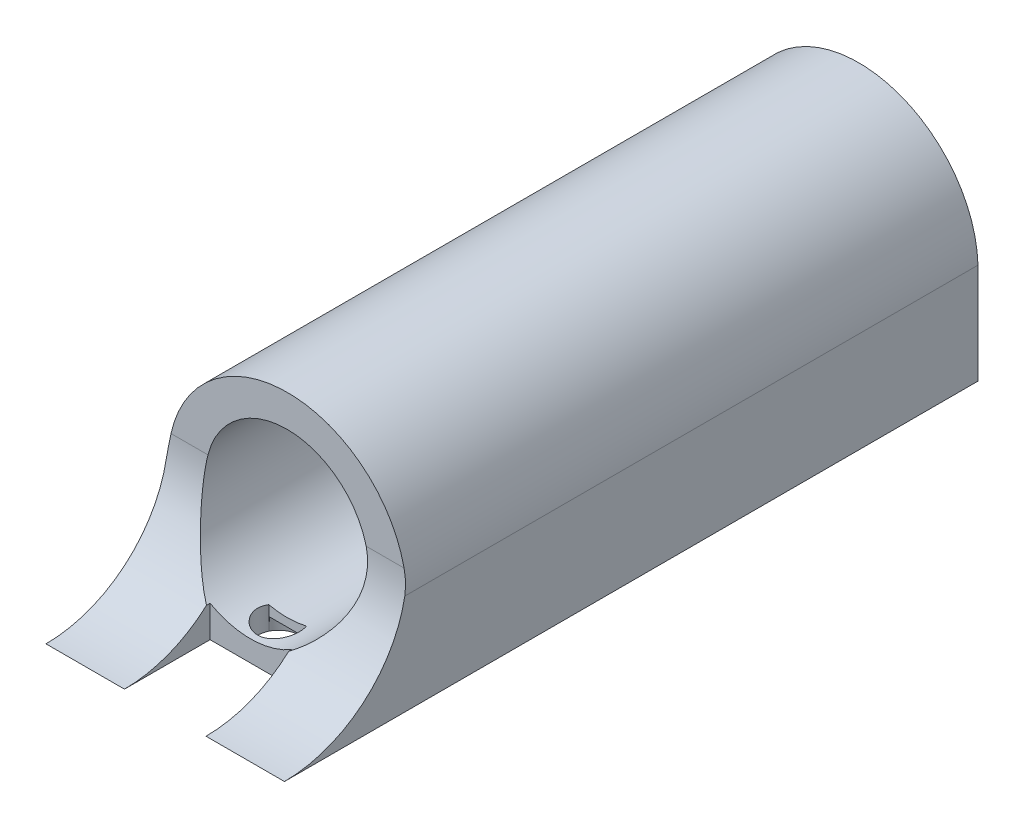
ISO-10303-21;
HEADER;
FILE_DESCRIPTION(('STEP AP214'),'2;1');
FILE_NAME('part.step','',(''),(''),'','','');
FILE_SCHEMA(('AUTOMOTIVE_DESIGN { 1 0 10303 214 1 1 1 1 }'));
ENDSEC;
DATA;
#1=APPLICATION_CONTEXT('core data for automotive mechanical design processes');
#2=APPLICATION_PROTOCOL_DEFINITION('international standard','automotive_design',2000,#1);
#3=PRODUCT_CONTEXT('',#1,'mechanical');
#4=PRODUCT('Part','Part','',(#3));
#5=PRODUCT_RELATED_PRODUCT_CATEGORY('part','',(#4));
#6=PRODUCT_DEFINITION_FORMATION('','',#4);
#7=PRODUCT_DEFINITION_CONTEXT('part definition',#1,'design');
#8=PRODUCT_DEFINITION('design','',#6,#7);
#9=PRODUCT_DEFINITION_SHAPE('','',#8);
#10=(LENGTH_UNIT() NAMED_UNIT(*) SI_UNIT(.MILLI.,.METRE.));
#11=(NAMED_UNIT(*) PLANE_ANGLE_UNIT() SI_UNIT($,.RADIAN.));
#12=(NAMED_UNIT(*) SI_UNIT($,.STERADIAN.) SOLID_ANGLE_UNIT());
#13=UNCERTAINTY_MEASURE_WITH_UNIT(LENGTH_MEASURE(1.E-05),#10,'distance_accuracy_value','');
#14=(GEOMETRIC_REPRESENTATION_CONTEXT(3) GLOBAL_UNCERTAINTY_ASSIGNED_CONTEXT((#13)) GLOBAL_UNIT_ASSIGNED_CONTEXT((#10,
#11,#12)) REPRESENTATION_CONTEXT('',''));
#15=CARTESIAN_POINT('',(0.,0.,0.));
#16=DIRECTION('',(0.,0.,1.));
#17=DIRECTION('',(1.,0.,0.));
#18=AXIS2_PLACEMENT_3D('',#15,#16,#17);
#19=CARTESIAN_POINT('',(31.8149068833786,36.7663866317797,-12.6919274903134));
#20=DIRECTION('',(0.,0.994521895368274,0.104528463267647));
#21=DIRECTION('',(1.,0.,0.));
#22=AXIS2_PLACEMENT_3D('',#19,#20,#21);
#23=CYLINDRICAL_SURFACE('',#22,3.23849999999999);
#24=CARTESIAN_POINT('',(31.8149068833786,24.2776075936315,-14.0045510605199));
#25=DIRECTION('',(0.,-1.,0.));
#26=DIRECTION('',(0.,0.,1.));
#27=AXIS2_PLACEMENT_3D('',#24,#25,#26);
#28=ELLIPSE('',#27,3.25633856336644,3.23849999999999);
#29=CARTESIAN_POINT('',(34.7373045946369,24.2776075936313,-15.4077571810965));
#30=VERTEX_POINT('',#29);
#31=CARTESIAN_POINT('',(28.8925091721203,24.2776075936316,-15.4077571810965));
#32=VERTEX_POINT('',#31);
#33=EDGE_CURVE('E170',#30,#32,#28,.F.);
#34=ORIENTED_EDGE('',*,*,#33,.F.);
#35=CARTESIAN_POINT('',(31.8149068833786,10.9269931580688,-15.4077571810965));
#36=DIRECTION('',(0.,0.,-1.));
#37=DIRECTION('',(0.,1.,0.));
#38=AXIS2_PLACEMENT_3D('',#35,#36,#37);
#39=ELLIPSE('',#38,30.9819918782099,3.23849999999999);
#40=CARTESIAN_POINT('',(34.6283142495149,26.2715150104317,-15.4077571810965));
#41=VERTEX_POINT('',#40);
#42=EDGE_CURVE('E11',#30,#41,#39,.F.);
#43=ORIENTED_EDGE('',*,*,#42,.T.);
#44=CARTESIAN_POINT('',(31.8149068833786,26.2715150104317,-13.7949829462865));
#45=DIRECTION('',(0.,1.,0.));
#46=DIRECTION('',(0.,0.,1.));
#47=AXIS2_PLACEMENT_3D('',#44,#45,#46);
#48=ELLIPSE('',#47,3.25633856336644,3.23849999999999);
#49=CARTESIAN_POINT('',(29.0014995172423,26.2715150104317,-15.4077571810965));
#50=VERTEX_POINT('',#49);
#51=EDGE_CURVE('E223',#50,#41,#48,.F.);
#52=ORIENTED_EDGE('',*,*,#51,.F.);
#53=CARTESIAN_POINT('',(31.8149068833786,10.9269931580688,-15.4077571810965));
#54=DIRECTION('',(0.,0.,-1.));
#55=DIRECTION('',(0.,1.,0.));
#56=AXIS2_PLACEMENT_3D('',#53,#54,#55);
#57=ELLIPSE('',#56,30.9819918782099,3.23849999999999);
#58=EDGE_CURVE('E27',#50,#32,#57,.F.);
#59=ORIENTED_EDGE('',*,*,#58,.T.);
#60=EDGE_LOOP('',(#34,#43,#52,#59));
#61=FACE_BOUND('',#60,.T.);
#62=ADVANCED_FACE('F16',(#61),#23,.F.);
#63=CARTESIAN_POINT('',(31.7387068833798,40.2415150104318,-192.846990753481));
#64=DIRECTION('',(0.,0.,1.));
#65=DIRECTION('',(1.,0.,0.));
#66=AXIS2_PLACEMENT_3D('',#63,#64,#65);
#67=CYLINDRICAL_SURFACE('',#66,12.7);
#68=CARTESIAN_POINT('',(31.7387068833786,40.2415150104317,-15.4077571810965));
#69=DIRECTION('',(0.,0.,1.));
#70=DIRECTION('',(1.,0.,0.));
#71=AXIS2_PLACEMENT_3D('',#68,#69,#70);
#72=CIRCLE('',#71,12.7);
#73=CARTESIAN_POINT('',(19.4193711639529,43.3276075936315,-15.4077571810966));
#74=VERTEX_POINT('',#73);
#75=CARTESIAN_POINT('',(44.0580426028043,43.3276075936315,-15.4077571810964));
#76=VERTEX_POINT('',#75);
#77=EDGE_CURVE('E130',#74,#76,#72,.F.);
#78=ORIENTED_EDGE('',*,*,#77,.F.);
#79=CARTESIAN_POINT('',(25.4649068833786,29.1993488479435,-9.13644274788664));
#80=CARTESIAN_POINT('',(25.2588227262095,29.3164647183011,-9.26594697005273));
#81=CARTESIAN_POINT('',(25.0570155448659,29.4387327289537,-9.39753074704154));
#82=CARTESIAN_POINT('',(24.6618501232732,29.6933639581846,-9.66353254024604));
#83=CARTESIAN_POINT('',(24.4684909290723,29.8257260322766,-9.79795023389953));
#84=CARTESIAN_POINT('',(24.0898521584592,30.1005209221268,-10.0684804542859));
#85=CARTESIAN_POINT('',(23.9045821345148,30.2429651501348,-10.2045947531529));
#86=CARTESIAN_POINT('',(23.5423749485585,30.5376675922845,-10.4772562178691));
#87=CARTESIAN_POINT('',(23.3654380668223,30.689926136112,-10.6138033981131));
#88=CARTESIAN_POINT('',(22.8442436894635,31.1640416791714,-11.0249319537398));
#89=CARTESIAN_POINT('',(22.5127905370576,31.5009260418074,-11.2986898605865));
#90=CARTESIAN_POINT('',(21.8862990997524,32.2137543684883,-11.8362568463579));
#91=CARTESIAN_POINT('',(21.5912360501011,32.5896714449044,-12.1000726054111));
#92=CARTESIAN_POINT('',(21.1266540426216,33.2569425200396,-12.5314798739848));
#93=CARTESIAN_POINT('',(20.9466439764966,33.5381997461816,-12.7034638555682));
#94=CARTESIAN_POINT('',(20.607116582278,34.1185513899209,-13.0373190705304));
#95=CARTESIAN_POINT('',(20.4475967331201,34.4176436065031,-13.1991915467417));
#96=CARTESIAN_POINT('',(20.1514506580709,35.0317852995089,-13.5100122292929));
#97=CARTESIAN_POINT('',(20.014743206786,35.3467727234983,-13.6590053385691));
#98=CARTESIAN_POINT('',(19.7655884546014,35.9924998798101,-13.9424933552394));
#99=CARTESIAN_POINT('',(19.6531376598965,36.3232373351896,-14.0769903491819));
#100=CARTESIAN_POINT('',(19.4699235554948,36.9467185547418,-14.3099116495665));
#101=CARTESIAN_POINT('',(19.3954083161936,37.2374791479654,-14.4107022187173));
#102=CARTESIAN_POINT('',(19.2665727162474,37.8275901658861,-14.5991439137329));
#103=CARTESIAN_POINT('',(19.2122488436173,38.1269390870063,-14.686797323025));
#104=CARTESIAN_POINT('',(19.1249758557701,38.7324334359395,-14.8478895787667));
#105=CARTESIAN_POINT('',(19.0920212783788,39.0385771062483,-14.9213320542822));
#106=CARTESIAN_POINT('',(19.0484593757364,39.6556487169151,-15.0531765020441));
#107=CARTESIAN_POINT('',(19.037848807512,39.9665759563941,-15.111580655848));
#108=CARTESIAN_POINT('',(19.0395045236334,40.5329112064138,-15.2034075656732));
#109=CARTESIAN_POINT('',(19.0478907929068,40.7879143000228,-15.2394549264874));
#110=CARTESIAN_POINT('',(19.0801607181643,41.2981856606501,-15.301093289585));
#111=CARTESIAN_POINT('',(19.104042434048,41.553453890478,-15.3266856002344));
#112=CARTESIAN_POINT('',(19.1674379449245,42.0634111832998,-15.3674863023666));
#113=CARTESIAN_POINT('',(19.2069839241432,42.3180979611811,-15.3826731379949));
#114=CARTESIAN_POINT('',(19.3015806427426,42.8250361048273,-15.4028242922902));
#115=CARTESIAN_POINT('',(19.3566343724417,43.0772869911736,-15.4077866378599));
#116=CARTESIAN_POINT('',(19.4193711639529,43.3276075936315,-15.4077571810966));
#117=B_SPLINE_CURVE_WITH_KNOTS('',3,(#79,#80,#81,#82,#83,#84,#85,#86,#87,#88,#89,#90,#91,#92,
#93,#94,#95,#96,#97,#98,#99,#100,#101,#102,#103,#104,#105,#106,#107,#108,#109,#110,#111,#112,
#113,#114,#115,#116),.UNSPECIFIED.,.F.,.F.,(4,2,2,2,2,2,2,2,2,2,2,2,2,2,2,2,2,2,4),(0.,
0.810184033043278,1.6202763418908,2.43130075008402,3.24235241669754,4.87809845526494,
6.51272509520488,7.63857992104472,8.76429609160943,9.88591433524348,11.0073709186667,
11.9562913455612,12.905046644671,13.8535593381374,14.8019343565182,15.5743121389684,
16.3465932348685,17.1204693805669,17.8944948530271),.UNSPECIFIED.);
#118=CARTESIAN_POINT('',(25.4649068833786,29.1993488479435,-9.13644274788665));
#119=VERTEX_POINT('',#118);
#120=EDGE_CURVE('E145',#119,#74,#117,.T.);
#121=ORIENTED_EDGE('',*,*,#120,.F.);
#122=DIRECTION('',(0.,0.,1.));
#123=VECTOR('',#122,1.);
#124=CARTESIAN_POINT('',(25.4649068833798,29.1993488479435,-192.846990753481));
#125=LINE('',#124,#123);
#126=CARTESIAN_POINT('',(25.4649068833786,29.1993488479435,-9.69275718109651));
#127=VERTEX_POINT('',#126);
#128=EDGE_CURVE('E526',#127,#119,#125,.T.);
#129=ORIENTED_EDGE('',*,*,#128,.F.);
#130=CARTESIAN_POINT('',(31.7387068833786,40.2415150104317,-9.69275718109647));
#131=DIRECTION('',(0.,0.,1.));
#132=DIRECTION('',(1.,0.,0.));
#133=AXIS2_PLACEMENT_3D('',#130,#131,#132);
#134=CIRCLE('',#133,12.7);
#135=CARTESIAN_POINT('',(38.1649068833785,29.28733984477,-9.69275718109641));
#136=VERTEX_POINT('',#135);
#137=EDGE_CURVE('E517',#136,#127,#134,.F.);
#138=ORIENTED_EDGE('',*,*,#137,.F.);
#139=DIRECTION('',(0.,0.,1.));
#140=VECTOR('',#139,1.);
#141=CARTESIAN_POINT('',(38.1649068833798,29.28733984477,-192.846990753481));
#142=LINE('',#141,#140);
#143=CARTESIAN_POINT('',(38.1649068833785,29.28733984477,-9.23305840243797));
#144=VERTEX_POINT('',#143);
#145=EDGE_CURVE('E528',#144,#136,#142,.F.);
#146=ORIENTED_EDGE('',*,*,#145,.F.);
#147=CARTESIAN_POINT('',(44.0580426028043,43.3276075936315,-15.4077571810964));
#148=CARTESIAN_POINT('',(44.095762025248,43.177040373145,-15.4077588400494));
#149=CARTESIAN_POINT('',(44.1307137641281,43.0257991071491,-15.4059715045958));
#150=CARTESIAN_POINT('',(44.1950372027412,42.7222226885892,-15.3987408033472));
#151=CARTESIAN_POINT('',(44.2244089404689,42.5698875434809,-15.3932974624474));
#152=CARTESIAN_POINT('',(44.3040646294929,42.1117531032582,-15.3713727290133));
#153=CARTESIAN_POINT('',(44.3459221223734,41.8046926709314,-15.3492967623));
#154=CARTESIAN_POINT('',(44.4068684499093,41.1913692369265,-15.2900966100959));
#155=CARTESIAN_POINT('',(44.4260695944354,40.8851098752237,-15.2530478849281));
#156=CARTESIAN_POINT('',(44.4423399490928,40.2741844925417,-15.1639897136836));
#157=CARTESIAN_POINT('',(44.4394094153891,39.9695184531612,-15.1119804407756));
#158=CARTESIAN_POINT('',(44.4119863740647,39.364148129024,-14.9934379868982));
#159=CARTESIAN_POINT('',(44.3875021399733,39.0634423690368,-14.926910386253));
#160=CARTESIAN_POINT('',(44.3178188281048,38.46785964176,-14.7800111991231));
#161=CARTESIAN_POINT('',(44.2726177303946,38.1729832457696,-14.6996382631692));
#162=CARTESIAN_POINT('',(44.1625070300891,37.5906546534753,-14.5259232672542));
#163=CARTESIAN_POINT('',(44.097585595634,37.3032070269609,-14.43257343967));
#164=CARTESIAN_POINT('',(43.9492109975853,36.737352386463,-14.2340251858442));
#165=CARTESIAN_POINT('',(43.8657574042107,36.4589455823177,-14.1288264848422));
#166=CARTESIAN_POINT('',(43.6769594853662,35.8987296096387,-13.9022731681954));
#167=CARTESIAN_POINT('',(43.5707340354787,35.6174377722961,-13.780375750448));
#168=CARTESIAN_POINT('',(43.3405561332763,35.0669476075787,-13.5262154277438));
#169=CARTESIAN_POINT('',(43.2165969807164,34.7977539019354,-13.3939486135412));
#170=CARTESIAN_POINT('',(42.9522175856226,34.2721113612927,-13.120463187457));
#171=CARTESIAN_POINT('',(42.811788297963,34.0156696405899,-12.9792396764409));
#172=CARTESIAN_POINT('',(42.5156939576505,33.5161246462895,-12.6893439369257));
#173=CARTESIAN_POINT('',(42.3600268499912,33.2730231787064,-12.5406707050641));
#174=CARTESIAN_POINT('',(42.0024257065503,32.7539233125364,-12.2074454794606));
#175=CARTESIAN_POINT('',(41.797417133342,32.4808735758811,-12.0215933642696));
#176=CARTESIAN_POINT('',(41.3684463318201,31.9545725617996,-11.6437491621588));
#177=CARTESIAN_POINT('',(41.1444800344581,31.7013255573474,-11.4517557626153));
#178=CARTESIAN_POINT('',(40.6788078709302,31.2150057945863,-11.0643524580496));
#179=CARTESIAN_POINT('',(40.4371145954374,30.9819189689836,-10.8689450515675));
#180=CARTESIAN_POINT('',(39.936518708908,30.5359386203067,-10.4773788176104));
#181=CARTESIAN_POINT('',(39.6776221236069,30.3230380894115,-10.2812202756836));
#182=CARTESIAN_POINT('',(39.2119449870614,29.9700677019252,-9.94164766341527));
#183=CARTESIAN_POINT('',(39.0090076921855,29.8254045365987,-9.79771595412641));
#184=CARTESIAN_POINT('',(38.5939431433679,29.5476940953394,-9.51283771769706));
#185=CARTESIAN_POINT('',(38.3818307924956,29.4146289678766,-9.37188686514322));
#186=CARTESIAN_POINT('',(38.1649068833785,29.28733984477,-9.23305840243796));
#187=B_SPLINE_CURVE_WITH_KNOTS('',3,(#147,#148,#149,#150,#151,#152,#153,#154,#155,#156,#157,
#158,#159,#160,#161,#162,#163,#164,#165,#166,#167,#168,#169,#170,#171,#172,#173,#174,#175,#176,
#177,#178,#179,#180,#181,#182,#183,#184,#185,#186),.UNSPECIFIED.,.F.,.F.,(4,2,2,2,2,2,2,2,2,2,2,
2,2,2,2,2,2,2,2,4),(0.,0.465585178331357,0.931167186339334,1.8619239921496,2.78804729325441,
3.71415987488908,4.63991711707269,5.56576464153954,6.49216875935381,7.41859436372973,
8.3910151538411,9.36380432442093,10.3371302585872,11.310587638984,12.4757361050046,
13.6411352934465,14.8057146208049,15.9698881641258,16.8329064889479,17.6945721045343),.UNSPECIFIED.);
#188=EDGE_CURVE('E129',#76,#144,#187,.T.);
#189=ORIENTED_EDGE('',*,*,#188,.F.);
#190=EDGE_LOOP('',(#78,#121,#129,#138,#146,#189));
#191=FACE_BOUND('',#190,.T.);
#192=CARTESIAN_POINT('',(31.7387068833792,40.2415150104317,-104.357657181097));
#193=DIRECTION('',(0.,0.,-1.));
#194=DIRECTION('',(-1.,0.,0.));
#195=AXIS2_PLACEMENT_3D('',#192,#193,#194);
#196=CIRCLE('',#195,12.7);
#197=CARTESIAN_POINT('',(19.0387068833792,40.2415150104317,-104.357657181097));
#198=VERTEX_POINT('',#197);
#199=EDGE_CURVE('E494',#198,#198,#196,.F.);
#200=ORIENTED_EDGE('',*,*,#199,.F.);
#201=EDGE_LOOP('',(#200));
#202=FACE_BOUND('',#201,.T.);
#203=CARTESIAN_POINT('',(28.8925091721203,27.8645542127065,-15.4077571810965));
#204=CARTESIAN_POINT('',(28.8540919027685,27.8733934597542,-15.3268845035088));
#205=CARTESIAN_POINT('',(28.818992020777,27.8816488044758,-15.2443687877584));
#206=CARTESIAN_POINT('',(28.7556488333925,27.8967809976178,-15.0766175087));
#207=CARTESIAN_POINT('',(28.7274060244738,27.9036577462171,-14.9913817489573));
#208=CARTESIAN_POINT('',(28.6780165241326,27.9158177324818,-14.8188108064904));
#209=CARTESIAN_POINT('',(28.6568663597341,27.9211017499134,-14.7314766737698));
#210=CARTESIAN_POINT('',(28.6218093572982,27.9299237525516,-14.5552836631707));
#211=CARTESIAN_POINT('',(28.6079021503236,27.9334618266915,-14.4664248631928));
#212=CARTESIAN_POINT('',(28.5874346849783,27.9386862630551,-14.2877281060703));
#213=CARTESIAN_POINT('',(28.580881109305,27.9403709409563,-14.1978893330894));
#214=CARTESIAN_POINT('',(28.5751961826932,27.9418317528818,-14.0179298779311));
#215=CARTESIAN_POINT('',(28.5760675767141,27.9416071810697,-13.9278091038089));
#216=CARTESIAN_POINT('',(28.5852313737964,27.9392543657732,-13.7480385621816));
#217=CARTESIAN_POINT('',(28.5935177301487,27.9371276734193,-13.6583884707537));
#218=CARTESIAN_POINT('',(28.6174264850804,27.9310418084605,-13.4801253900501));
#219=CARTESIAN_POINT('',(28.633051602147,27.9270819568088,-13.3915127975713));
#220=CARTESIAN_POINT('',(28.6904603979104,27.9126944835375,-13.1296636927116));
#221=CARTESIAN_POINT('',(28.7428648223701,27.8997338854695,-12.958763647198));
#222=CARTESIAN_POINT('',(28.8745477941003,27.86851540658,-12.6282191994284));
#223=CARTESIAN_POINT('',(28.9538377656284,27.8502552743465,-12.4685796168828));
#224=CARTESIAN_POINT('',(29.1388544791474,27.8101081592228,-12.1616817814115));
#225=CARTESIAN_POINT('',(29.2450572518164,27.7881585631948,-12.0147182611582));
#226=CARTESIAN_POINT('',(29.4802708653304,27.7433648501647,-11.7405312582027));
#227=CARTESIAN_POINT('',(29.6092801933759,27.7205207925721,-11.6133064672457));
#228=CARTESIAN_POINT('',(29.8894155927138,27.6760624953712,-11.3797901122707));
#229=CARTESIAN_POINT('',(30.0409101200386,27.654479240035,-11.2739344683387));
#230=CARTESIAN_POINT('',(30.3602148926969,27.615529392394,-11.0893395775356));
#231=CARTESIAN_POINT('',(30.5280228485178,27.5981622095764,-11.0105965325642));
#232=CARTESIAN_POINT('',(30.7900253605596,27.5766825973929,-10.9141137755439));
#233=CARTESIAN_POINT('',(30.8801222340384,27.570240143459,-10.8853669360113));
#234=CARTESIAN_POINT('',(31.0626245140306,27.5591945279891,-10.8358637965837));
#235=CARTESIAN_POINT('',(31.1550299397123,27.5545913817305,-10.8151075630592));
#236=CARTESIAN_POINT('',(31.341614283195,27.5473809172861,-10.7817636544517));
#237=CARTESIAN_POINT('',(31.4357970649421,27.544778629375,-10.7691965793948));
#238=CARTESIAN_POINT('',(31.6249551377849,27.5416690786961,-10.7524133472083));
#239=CARTESIAN_POINT('',(31.719930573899,27.5411622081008,-10.7481987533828));
#240=CARTESIAN_POINT('',(31.8149068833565,27.541743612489,-10.7482124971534));
#241=B_SPLINE_CURVE_WITH_KNOTS('',3,(#203,#204,#205,#206,#207,#208,#209,#210,#211,#212,#213,
#214,#215,#216,#217,#218,#219,#220,#221,#222,#223,#224,#225,#226,#227,#228,#229,#230,#231,#232,
#233,#234,#235,#236,#237,#238,#239,#240),.UNSPECIFIED.,.F.,.F.,(4,2,2,2,2,2,2,2,2,2,2,2,2,2,2,2,
2,2,4),(0.,0.269834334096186,0.539688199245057,0.80940973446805,1.07911752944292,
1.34907022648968,1.61912272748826,1.88895520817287,2.15888772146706,2.69385140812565,
3.22904269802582,3.77445646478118,4.31983406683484,4.87540979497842,5.43090766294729,
5.71496220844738,5.99901911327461,6.28378783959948,6.5686098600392),.UNSPECIFIED.);
#242=CARTESIAN_POINT('',(28.8925091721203,27.8645542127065,-15.4077571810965));
#243=VERTEX_POINT('',#242);
#244=CARTESIAN_POINT('',(31.8149068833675,27.541743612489,-10.7482124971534));
#245=VERTEX_POINT('',#244);
#246=EDGE_CURVE('E139',#243,#245,#241,.T.);
#247=ORIENTED_EDGE('',*,*,#246,.F.);
#248=CARTESIAN_POINT('',(31.7387068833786,40.2415150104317,-15.4077571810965));
#249=DIRECTION('',(0.,0.,-1.));
#250=DIRECTION('',(-1.,0.,0.));
#251=AXIS2_PLACEMENT_3D('',#248,#249,#250);
#252=CIRCLE('',#251,12.7);
#253=CARTESIAN_POINT('',(34.7373045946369,27.9005907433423,-15.4077571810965));
#254=VERTEX_POINT('',#253);
#255=EDGE_CURVE('E156',#243,#254,#252,.F.);
#256=ORIENTED_EDGE('',*,*,#255,.T.);
#257=CARTESIAN_POINT('',(31.8149068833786,27.541743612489,-10.7482124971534));
#258=CARTESIAN_POINT('',(31.9041876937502,27.5422703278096,-10.7482019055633));
#259=CARTESIAN_POINT('',(31.9934563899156,27.5437562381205,-10.75192468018));
#260=CARTESIAN_POINT('',(32.171313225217,27.5485758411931,-10.7667518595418));
#261=CARTESIAN_POINT('',(32.2599014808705,27.5519092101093,-10.7778549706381));
#262=CARTESIAN_POINT('',(32.4355917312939,27.5603446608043,-10.8073273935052));
#263=CARTESIAN_POINT('',(32.522696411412,27.5654430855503,-10.8256816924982));
#264=CARTESIAN_POINT('',(32.6949673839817,27.5772726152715,-10.8694800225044));
#265=CARTESIAN_POINT('',(32.780133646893,27.58400374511,-10.8949241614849));
#266=CARTESIAN_POINT('',(33.0318152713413,27.6064007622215,-10.9815999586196));
#267=CARTESIAN_POINT('',(33.1946963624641,27.6242795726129,-11.0532059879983));
#268=CARTESIAN_POINT('',(33.5060990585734,27.6641119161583,-11.2218005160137));
#269=CARTESIAN_POINT('',(33.6546169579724,27.6860664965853,-11.3187955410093));
#270=CARTESIAN_POINT('',(33.9367688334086,27.7323421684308,-11.5378747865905));
#271=CARTESIAN_POINT('',(34.070008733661,27.7567043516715,-11.6604589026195));
#272=CARTESIAN_POINT('',(34.3144003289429,27.8048209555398,-11.9260807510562));
#273=CARTESIAN_POINT('',(34.425545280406,27.8285751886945,-12.0691247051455));
#274=CARTESIAN_POINT('',(34.6248471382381,27.8733750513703,-12.3751893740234));
#275=CARTESIAN_POINT('',(34.7124917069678,27.8943559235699,-12.5385566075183));
#276=CARTESIAN_POINT('',(34.8223807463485,27.9215166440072,-12.7931370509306));
#277=CARTESIAN_POINT('',(34.8554215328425,27.9298538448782,-12.8796158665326));
#278=CARTESIAN_POINT('',(34.9140838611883,27.944852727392,-13.055184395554));
#279=CARTESIAN_POINT('',(34.9397084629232,27.9515150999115,-13.1442730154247));
#280=CARTESIAN_POINT('',(34.9829558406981,27.9628611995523,-13.3229014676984));
#281=CARTESIAN_POINT('',(35.0007055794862,27.9675762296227,-13.4124086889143));
#282=CARTESIAN_POINT('',(35.0286722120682,27.9750428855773,-13.5926395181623));
#283=CARTESIAN_POINT('',(35.0388921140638,27.9777952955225,-13.6833626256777));
#284=CARTESIAN_POINT('',(35.0517253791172,27.9812559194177,-13.865458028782));
#285=CARTESIAN_POINT('',(35.0543325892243,27.9819624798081,-13.9568307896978));
#286=CARTESIAN_POINT('',(35.0519010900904,27.9813051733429,-14.1394328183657));
#287=CARTESIAN_POINT('',(35.0468651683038,27.9799420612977,-14.23066212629));
#288=CARTESIAN_POINT('',(35.028877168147,27.9751027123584,-14.4156058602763));
#289=CARTESIAN_POINT('',(35.0156462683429,27.9715520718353,-14.509291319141));
#290=CARTESIAN_POINT('',(34.9811509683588,27.9623916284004,-14.6950765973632));
#291=CARTESIAN_POINT('',(34.9598857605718,27.9567816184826,-14.7871762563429));
#292=CARTESIAN_POINT('',(34.9094836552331,27.9436752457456,-14.9691608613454));
#293=CARTESIAN_POINT('',(34.8803384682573,27.9361768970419,-15.0590433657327));
#294=CARTESIAN_POINT('',(34.8144524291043,27.9195467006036,-15.2358118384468));
#295=CARTESIAN_POINT('',(34.7777125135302,27.9104150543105,-15.3226981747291));
#296=CARTESIAN_POINT('',(34.7373045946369,27.9005907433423,-15.4077571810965));
#297=B_SPLINE_CURVE_WITH_KNOTS('',3,(#257,#258,#259,#260,#261,#262,#263,#264,#265,#266,#267,
#268,#269,#270,#271,#272,#273,#274,#275,#276,#277,#278,#279,#280,#281,#282,#283,#284,#285,#286,
#287,#288,#289,#290,#291,#292,#293,#294,#295,#296),.UNSPECIFIED.,.F.,.F.,(4,2,2,2,2,2,2,2,2,2,2,
2,2,2,2,2,2,2,2,4),(0.,0.267753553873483,0.53546018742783,0.802615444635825,1.06977477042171,
1.60354322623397,2.13744902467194,2.6829695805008,3.22865637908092,3.78541821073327,
4.06398481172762,4.34243631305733,4.6162190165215,4.88989228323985,5.16378668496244,
5.43758122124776,5.72124564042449,6.00493858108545,6.28893112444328,6.57288866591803),.UNSPECIFIED.);
#298=EDGE_CURVE('E228',#245,#254,#297,.T.);
#299=ORIENTED_EDGE('',*,*,#298,.F.);
#300=EDGE_LOOP('',(#247,#256,#299));
#301=FACE_BOUND('',#300,.T.);
#302=ADVANCED_FACE('F205',(#191,#202,#301),#67,.F.);
#303=CARTESIAN_POINT('',(-437.084132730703,24.2776075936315,137.712993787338));
#304=DIRECTION('',(0.,-1.,0.));
#305=DIRECTION('',(1.,0.,0.));
#306=AXIS2_PLACEMENT_3D('',#303,#304,#305);
#307=PLANE('',#306);
#308=DIRECTION('',(0.,0.,1.));
#309=VECTOR('',#308,1.);
#310=CARTESIAN_POINT('',(13.2483019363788,24.2776075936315,140.88791943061));
#311=LINE('',#310,#309);
#312=CARTESIAN_POINT('',(13.2483019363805,24.2776075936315,-104.357657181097));
#313=VERTEX_POINT('',#312);
#314=CARTESIAN_POINT('',(13.2483019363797,24.2776075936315,3.64224281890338));
#315=VERTEX_POINT('',#314);
#316=EDGE_CURVE('E177',#313,#315,#311,.T.);
#317=ORIENTED_EDGE('',*,*,#316,.F.);
#318=DIRECTION('',(1.,0.,0.));
#319=VECTOR('',#318,1.);
#320=CARTESIAN_POINT('',(-437.084132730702,24.2776075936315,-104.357657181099));
#321=LINE('',#320,#319);
#322=CARTESIAN_POINT('',(50.381511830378,24.2776075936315,-104.357657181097));
#323=VERTEX_POINT('',#322);
#324=EDGE_CURVE('E159',#313,#323,#321,.T.);
#325=ORIENTED_EDGE('',*,*,#324,.T.);
#326=DIRECTION('',(0.,0.,-1.));
#327=VECTOR('',#326,1.);
#328=CARTESIAN_POINT('',(50.3815118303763,24.2776075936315,137.712993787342));
#329=LINE('',#328,#327);
#330=CARTESIAN_POINT('',(50.3815118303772,24.2776075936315,3.64224281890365));
#331=VERTEX_POINT('',#330);
#332=EDGE_CURVE('E162',#323,#331,#329,.F.);
#333=ORIENTED_EDGE('',*,*,#332,.T.);
#334=DIRECTION('',(-1.,0.,0.));
#335=VECTOR('',#334,1.);
#336=CARTESIAN_POINT('',(50.3815118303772,24.2776075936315,3.64224281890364));
#337=LINE('',#336,#335);
#338=CARTESIAN_POINT('',(38.1649068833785,24.2776075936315,3.64224281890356));
#339=VERTEX_POINT('',#338);
#340=EDGE_CURVE('E165',#331,#339,#337,.T.);
#341=ORIENTED_EDGE('',*,*,#340,.T.);
#342=DIRECTION('',(0.,0.,1.));
#343=VECTOR('',#342,1.);
#344=CARTESIAN_POINT('',(38.1649068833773,24.2776075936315,162.392242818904));
#345=LINE('',#344,#343);
#346=CARTESIAN_POINT('',(38.1649068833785,24.2776075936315,-9.69275718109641));
#347=VERTEX_POINT('',#346);
#348=EDGE_CURVE('E533',#347,#339,#345,.T.);
#349=ORIENTED_EDGE('',*,*,#348,.F.);
#350=DIRECTION('',(1.,0.,0.));
#351=VECTOR('',#350,1.);
#352=CARTESIAN_POINT('',(31.8149068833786,24.2776075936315,-9.69275718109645));
#353=LINE('',#352,#351);
#354=CARTESIAN_POINT('',(25.4649068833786,24.2776075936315,-9.69275718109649));
#355=VERTEX_POINT('',#354);
#356=EDGE_CURVE('E518',#355,#347,#353,.T.);
#357=ORIENTED_EDGE('',*,*,#356,.F.);
#358=DIRECTION('',(0.,0.,-1.));
#359=VECTOR('',#358,1.);
#360=CARTESIAN_POINT('',(25.4649068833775,24.2776075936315,137.712993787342));
#361=LINE('',#360,#359);
#362=CARTESIAN_POINT('',(25.4649068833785,24.2776075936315,3.64224281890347));
#363=VERTEX_POINT('',#362);
#364=EDGE_CURVE('E166',#355,#363,#361,.F.);
#365=ORIENTED_EDGE('',*,*,#364,.T.);
#366=DIRECTION('',(-1.,0.,0.));
#367=VECTOR('',#366,1.);
#368=CARTESIAN_POINT('',(25.4649068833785,24.2776075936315,3.64224281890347));
#369=LINE('',#368,#367);
#370=EDGE_CURVE('E169',#363,#315,#369,.T.);
#371=ORIENTED_EDGE('',*,*,#370,.T.);
#372=EDGE_LOOP('',(#317,#325,#333,#341,#349,#357,#365,#371));
#373=FACE_BOUND('',#372,.T.);
#374=CARTESIAN_POINT('',(31.8149068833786,24.2776075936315,-10.7482124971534));
#375=CARTESIAN_POINT('',(31.9056274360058,24.2776075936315,-10.748203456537));
#376=CARTESIAN_POINT('',(31.9963436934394,24.2776075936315,-10.752045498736));
#377=CARTESIAN_POINT('',(32.1771244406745,24.2776075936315,-10.7673618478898));
#378=CARTESIAN_POINT('',(32.2671889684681,24.2776075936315,-10.7788357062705));
#379=CARTESIAN_POINT('',(32.445959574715,24.2776075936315,-10.8093331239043));
#380=CARTESIAN_POINT('',(32.5346667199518,24.2776075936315,-10.8283504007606));
#381=CARTESIAN_POINT('',(32.7101414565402,24.2776075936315,-10.873775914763));
#382=CARTESIAN_POINT('',(32.7969090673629,24.2776075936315,-10.9001840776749));
#383=CARTESIAN_POINT('',(33.0534544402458,24.2776075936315,-10.9902688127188));
#384=CARTESIAN_POINT('',(33.2195604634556,24.2776075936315,-11.0648203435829));
#385=CARTESIAN_POINT('',(33.5368155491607,24.2776075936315,-11.24063521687));
#386=CARTESIAN_POINT('',(33.6879672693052,24.2776075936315,-11.3418938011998));
#387=CARTESIAN_POINT('',(33.9716021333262,24.2776075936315,-11.5685179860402));
#388=CARTESIAN_POINT('',(34.1040389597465,24.2776075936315,-11.6939416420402));
#389=CARTESIAN_POINT('',(34.3461293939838,24.2776075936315,-11.9651649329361));
#390=CARTESIAN_POINT('',(34.4557777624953,24.2776075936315,-12.1109692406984));
#391=CARTESIAN_POINT('',(34.6497600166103,24.2776075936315,-12.4196007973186));
#392=CARTESIAN_POINT('',(34.7339598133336,24.2776075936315,-12.5825123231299));
#393=CARTESIAN_POINT('',(34.873947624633,24.2776075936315,-12.9200843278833));
#394=CARTESIAN_POINT('',(34.9297404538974,24.2776075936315,-13.0947428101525));
#395=CARTESIAN_POINT('',(35.0116277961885,24.2776075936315,-13.4517646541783));
#396=CARTESIAN_POINT('',(35.03757565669,24.2776075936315,-13.6341615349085));
#397=CARTESIAN_POINT('',(35.058544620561,24.2776075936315,-14.0008575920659));
#398=CARTESIAN_POINT('',(35.0535597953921,24.2776075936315,-14.1851571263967));
#399=CARTESIAN_POINT('',(35.0231884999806,24.2776075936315,-14.457535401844));
#400=CARTESIAN_POINT('',(35.0094186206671,24.2776075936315,-14.5470539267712));
#401=CARTESIAN_POINT('',(34.9745074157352,24.2776075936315,-14.7246664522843));
#402=CARTESIAN_POINT('',(34.9533661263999,24.2776075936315,-14.8127604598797));
#403=CARTESIAN_POINT('',(34.9038343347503,24.2776075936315,-14.9869325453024));
#404=CARTESIAN_POINT('',(34.8754398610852,24.2776075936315,-15.0730094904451));
#405=CARTESIAN_POINT('',(34.8116059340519,24.2776075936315,-15.242516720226));
#406=CARTESIAN_POINT('',(34.7761659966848,24.2776075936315,-15.3259468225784));
#407=CARTESIAN_POINT('',(34.7373045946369,24.2776075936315,-15.4077571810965));
#408=B_SPLINE_CURVE_WITH_KNOTS('',3,(#374,#375,#376,#377,#378,#379,#380,#381,#382,#383,#384,
#385,#386,#387,#388,#389,#390,#391,#392,#393,#394,#395,#396,#397,#398,#399,#400,#401,#402,#403,
#404,#405,#406,#407),.UNSPECIFIED.,.F.,.F.,(4,2,2,2,2,2,2,2,2,2,2,2,2,2,2,2,4),(0.,
0.272072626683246,0.544129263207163,0.815959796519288,1.0877875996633,1.63118557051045,
2.17448679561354,2.71910993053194,3.2638581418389,3.81142851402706,4.35890604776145,
4.90906244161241,5.45932428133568,5.73078468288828,6.00224374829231,6.2738517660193,
6.54547844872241),.UNSPECIFIED.);
#409=CARTESIAN_POINT('',(31.8149068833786,24.2776075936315,-10.7482124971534));
#410=VERTEX_POINT('',#409);
#411=EDGE_CURVE('E36',#30,#410,#408,.F.);
#412=ORIENTED_EDGE('',*,*,#411,.F.);
#413=ORIENTED_EDGE('',*,*,#33,.T.);
#414=CARTESIAN_POINT('',(28.8925091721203,24.2776075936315,-15.4077571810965));
#415=CARTESIAN_POINT('',(28.8530302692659,24.2776075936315,-15.3246478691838));
#416=CARTESIAN_POINT('',(28.8170829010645,24.2776075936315,-15.2398667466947));
#417=CARTESIAN_POINT('',(28.7524627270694,24.2776075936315,-15.0675816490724));
#418=CARTESIAN_POINT('',(28.7237894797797,24.2776075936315,-14.9800778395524));
#419=CARTESIAN_POINT('',(28.6739414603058,24.2776075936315,-14.8030192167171));
#420=CARTESIAN_POINT('',(28.6527615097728,24.2776075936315,-14.7134658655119));
#421=CARTESIAN_POINT('',(28.6180127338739,24.2776075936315,-14.5329203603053));
#422=CARTESIAN_POINT('',(28.604443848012,24.2776075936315,-14.441928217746));
#423=CARTESIAN_POINT('',(28.575318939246,24.2776075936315,-14.1676689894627));
#424=CARTESIAN_POINT('',(28.5713203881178,24.2776075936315,-13.9830325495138));
#425=CARTESIAN_POINT('',(28.5943553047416,24.2776075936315,-13.6158419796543));
#426=CARTESIAN_POINT('',(28.6213825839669,24.2776075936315,-13.433287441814));
#427=CARTESIAN_POINT('',(28.7057273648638,24.2776075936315,-13.0751281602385));
#428=CARTESIAN_POINT('',(28.7630696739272,24.2776075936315,-12.899529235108));
#429=CARTESIAN_POINT('',(28.9064993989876,24.2776075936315,-12.5604532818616));
#430=CARTESIAN_POINT('',(28.9925924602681,24.2776075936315,-12.3969786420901));
#431=CARTESIAN_POINT('',(29.1908910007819,24.2776075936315,-12.0872446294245));
#432=CARTESIAN_POINT('',(29.303036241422,24.2776075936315,-11.9409466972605));
#433=CARTESIAN_POINT('',(29.5503914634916,24.2776075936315,-11.6693968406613));
#434=CARTESIAN_POINT('',(29.6855964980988,24.2776075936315,-11.5441404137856));
#435=CARTESIAN_POINT('',(29.9745274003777,24.2776075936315,-11.3188520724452));
#436=CARTESIAN_POINT('',(30.1281614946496,24.2776075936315,-11.2187022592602));
#437=CARTESIAN_POINT('',(30.4502541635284,24.2776075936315,-11.0457436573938));
#438=CARTESIAN_POINT('',(30.618714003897,24.2776075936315,-10.9729372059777));
#439=CARTESIAN_POINT('',(30.8741934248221,24.2776075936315,-10.8873955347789));
#440=CARTESIAN_POINT('',(30.9575351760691,24.2776075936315,-10.8631905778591));
#441=CARTESIAN_POINT('',(31.1259177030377,24.2776075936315,-10.8215684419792));
#442=CARTESIAN_POINT('',(31.2109584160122,24.2776075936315,-10.8041510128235));
#443=CARTESIAN_POINT('',(31.3821959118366,24.2776075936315,-10.7762320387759));
#444=CARTESIAN_POINT('',(31.4683931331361,24.2776075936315,-10.7657331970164));
#445=CARTESIAN_POINT('',(31.6413611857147,24.2776075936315,-10.7517193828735));
#446=CARTESIAN_POINT('',(31.7281320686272,24.2776075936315,-10.74820504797));
#447=CARTESIAN_POINT('',(31.8149068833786,24.2776075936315,-10.7482124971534));
#448=B_SPLINE_CURVE_WITH_KNOTS('',3,(#414,#415,#416,#417,#418,#419,#420,#421,#422,#423,#424,
#425,#426,#427,#428,#429,#430,#431,#432,#433,#434,#435,#436,#437,#438,#439,#440,#441,#442,#443,
#444,#445,#446,#447),.UNSPECIFIED.,.F.,.F.,(4,2,2,2,2,2,2,2,2,2,2,2,2,2,2,2,4),(0.,
0.275937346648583,0.551857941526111,0.827587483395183,1.10331483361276,1.65450324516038,
2.20558173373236,2.75711188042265,3.30875038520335,3.85912585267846,4.40938340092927,
4.95700642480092,5.50467624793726,5.76480666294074,6.0249274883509,6.28514988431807,
6.54539602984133),.UNSPECIFIED.);
#449=EDGE_CURVE('E152',#410,#32,#448,.F.);
#450=ORIENTED_EDGE('',*,*,#449,.F.);
#451=EDGE_LOOP('',(#412,#413,#450));
#452=FACE_BOUND('',#451,.T.);
#453=CARTESIAN_POINT('',(41.8149068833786,24.2776075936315,-22.2608896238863));
#454=DIRECTION('',(0.,-1.,0.));
#455=DIRECTION('',(1.,0.,0.));
#456=AXIS2_PLACEMENT_3D('',#453,#454,#455);
#457=CIRCLE('',#456,2.);
#458=CARTESIAN_POINT('',(43.8149068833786,24.2776075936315,-22.2608896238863));
#459=VERTEX_POINT('',#458);
#460=EDGE_CURVE('E337',#459,#459,#457,.T.);
#461=ORIENTED_EDGE('',*,*,#460,.F.);
#462=EDGE_LOOP('',(#461));
#463=FACE_BOUND('',#462,.T.);
#464=CARTESIAN_POINT('',(41.8149068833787,24.2776075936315,-32.2608896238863));
#465=DIRECTION('',(0.,-1.,0.));
#466=DIRECTION('',(1.,0.,0.));
#467=AXIS2_PLACEMENT_3D('',#464,#465,#466);
#468=CIRCLE('',#467,2.);
#469=CARTESIAN_POINT('',(43.8149068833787,24.2776075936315,-32.2608896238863));
#470=VERTEX_POINT('',#469);
#471=EDGE_CURVE('E341',#470,#470,#468,.T.);
#472=ORIENTED_EDGE('',*,*,#471,.F.);
#473=EDGE_LOOP('',(#472));
#474=FACE_BOUND('',#473,.T.);
#475=CARTESIAN_POINT('',(41.8149068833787,24.2776075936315,-42.2608896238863));
#476=DIRECTION('',(0.,-1.,0.));
#477=DIRECTION('',(1.,0.,0.));
#478=AXIS2_PLACEMENT_3D('',#475,#476,#477);
#479=CIRCLE('',#478,2.);
#480=CARTESIAN_POINT('',(43.8149068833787,24.2776075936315,-42.2608896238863));
#481=VERTEX_POINT('',#480);
#482=EDGE_CURVE('E345',#481,#481,#479,.T.);
#483=ORIENTED_EDGE('',*,*,#482,.F.);
#484=EDGE_LOOP('',(#483));
#485=FACE_BOUND('',#484,.T.);
#486=CARTESIAN_POINT('',(31.8149068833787,24.2776075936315,-32.2608896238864));
#487=DIRECTION('',(0.,-1.,0.));
#488=DIRECTION('',(1.,0.,0.));
#489=AXIS2_PLACEMENT_3D('',#486,#487,#488);
#490=CIRCLE('',#489,2.);
#491=CARTESIAN_POINT('',(33.8149068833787,24.2776075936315,-32.2608896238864));
#492=VERTEX_POINT('',#491);
#493=EDGE_CURVE('E349',#492,#492,#490,.T.);
#494=ORIENTED_EDGE('',*,*,#493,.F.);
#495=EDGE_LOOP('',(#494));
#496=FACE_BOUND('',#495,.T.);
#497=CARTESIAN_POINT('',(31.8149068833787,24.2776075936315,-42.2608896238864));
#498=DIRECTION('',(0.,-1.,0.));
#499=DIRECTION('',(1.,0.,0.));
#500=AXIS2_PLACEMENT_3D('',#497,#498,#499);
#501=CIRCLE('',#500,2.);
#502=CARTESIAN_POINT('',(33.8149068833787,24.2776075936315,-42.2608896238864));
#503=VERTEX_POINT('',#502);
#504=EDGE_CURVE('E353',#503,#503,#501,.T.);
#505=ORIENTED_EDGE('',*,*,#504,.F.);
#506=EDGE_LOOP('',(#505));
#507=FACE_BOUND('',#506,.T.);
#508=CARTESIAN_POINT('',(21.8149068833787,24.2776075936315,-32.2608896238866));
#509=DIRECTION('',(0.,-1.,0.));
#510=DIRECTION('',(1.,0.,0.));
#511=AXIS2_PLACEMENT_3D('',#508,#509,#510);
#512=CIRCLE('',#511,2.);
#513=CARTESIAN_POINT('',(23.8149068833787,24.2776075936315,-32.2608896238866));
#514=VERTEX_POINT('',#513);
#515=EDGE_CURVE('E357',#514,#514,#512,.T.);
#516=ORIENTED_EDGE('',*,*,#515,.F.);
#517=EDGE_LOOP('',(#516));
#518=FACE_BOUND('',#517,.T.);
#519=CARTESIAN_POINT('',(21.8149068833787,24.2776075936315,-42.2608896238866));
#520=DIRECTION('',(0.,-1.,0.));
#521=DIRECTION('',(1.,0.,0.));
#522=AXIS2_PLACEMENT_3D('',#519,#520,#521);
#523=CIRCLE('',#522,2.);
#524=CARTESIAN_POINT('',(23.8149068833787,24.2776075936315,-42.2608896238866));
#525=VERTEX_POINT('',#524);
#526=EDGE_CURVE('E21',#525,#525,#523,.T.);
#527=ORIENTED_EDGE('',*,*,#526,.F.);
#528=EDGE_LOOP('',(#527));
#529=FACE_BOUND('',#528,.T.);
#530=CARTESIAN_POINT('',(31.8149068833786,24.2776075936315,-22.2608896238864));
#531=DIRECTION('',(0.,-1.,0.));
#532=DIRECTION('',(1.,0.,0.));
#533=AXIS2_PLACEMENT_3D('',#530,#531,#532);
#534=CIRCLE('',#533,2.);
#535=CARTESIAN_POINT('',(33.8149068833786,24.2776075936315,-22.2608896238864));
#536=VERTEX_POINT('',#535);
#537=EDGE_CURVE('E364',#536,#536,#534,.T.);
#538=ORIENTED_EDGE('',*,*,#537,.F.);
#539=EDGE_LOOP('',(#538));
#540=FACE_BOUND('',#539,.T.);
#541=CARTESIAN_POINT('',(21.8149068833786,24.2776075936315,-22.2608896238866));
#542=DIRECTION('',(0.,-1.,0.));
#543=DIRECTION('',(1.,0.,0.));
#544=AXIS2_PLACEMENT_3D('',#541,#542,#543);
#545=CIRCLE('',#544,2.);
#546=CARTESIAN_POINT('',(23.8149068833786,24.2776075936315,-22.2608896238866));
#547=VERTEX_POINT('',#546);
#548=EDGE_CURVE('E368',#547,#547,#545,.T.);
#549=ORIENTED_EDGE('',*,*,#548,.F.);
#550=EDGE_LOOP('',(#549));
#551=FACE_BOUND('',#550,.T.);
#552=CARTESIAN_POINT('',(21.814906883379,24.2776075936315,-89.3585571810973));
#553=DIRECTION('',(0.,-1.,0.));
#554=DIRECTION('',(1.,0.,0.));
#555=AXIS2_PLACEMENT_3D('',#552,#553,#554);
#556=CIRCLE('',#555,2.);
#557=CARTESIAN_POINT('',(23.814906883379,24.2776075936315,-89.3585571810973));
#558=VERTEX_POINT('',#557);
#559=EDGE_CURVE('E372',#558,#558,#556,.T.);
#560=ORIENTED_EDGE('',*,*,#559,.F.);
#561=EDGE_LOOP('',(#560));
#562=FACE_BOUND('',#561,.T.);
#563=CARTESIAN_POINT('',(21.8149068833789,24.2776075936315,-79.3585571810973));
#564=DIRECTION('',(0.,-1.,0.));
#565=DIRECTION('',(1.,0.,0.));
#566=AXIS2_PLACEMENT_3D('',#563,#564,#565);
#567=CIRCLE('',#566,2.);
#568=CARTESIAN_POINT('',(23.8149068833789,24.2776075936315,-79.3585571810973));
#569=VERTEX_POINT('',#568);
#570=EDGE_CURVE('E376',#569,#569,#567,.T.);
#571=ORIENTED_EDGE('',*,*,#570,.F.);
#572=EDGE_LOOP('',(#571));
#573=FACE_BOUND('',#572,.T.);
#574=CARTESIAN_POINT('',(31.8149068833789,24.2776075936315,-79.3585571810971));
#575=DIRECTION('',(0.,-1.,0.));
#576=DIRECTION('',(1.,0.,0.));
#577=AXIS2_PLACEMENT_3D('',#574,#575,#576);
#578=CIRCLE('',#577,2.);
#579=CARTESIAN_POINT('',(33.8149068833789,24.2776075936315,-79.3585571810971));
#580=VERTEX_POINT('',#579);
#581=EDGE_CURVE('E380',#580,#580,#578,.T.);
#582=ORIENTED_EDGE('',*,*,#581,.F.);
#583=EDGE_LOOP('',(#582));
#584=FACE_BOUND('',#583,.T.);
#585=CARTESIAN_POINT('',(41.8149068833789,24.2776075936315,-79.358557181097));
#586=DIRECTION('',(0.,-1.,0.));
#587=DIRECTION('',(1.,0.,0.));
#588=AXIS2_PLACEMENT_3D('',#585,#586,#587);
#589=CIRCLE('',#588,2.);
#590=CARTESIAN_POINT('',(43.8149068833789,24.2776075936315,-79.358557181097));
#591=VERTEX_POINT('',#590);
#592=EDGE_CURVE('E384',#591,#591,#589,.T.);
#593=ORIENTED_EDGE('',*,*,#592,.F.);
#594=EDGE_LOOP('',(#593));
#595=FACE_BOUND('',#594,.T.);
#596=CARTESIAN_POINT('',(41.814906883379,24.2776075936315,-99.358557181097));
#597=DIRECTION('',(0.,-1.,0.));
#598=DIRECTION('',(1.,0.,0.));
#599=AXIS2_PLACEMENT_3D('',#596,#597,#598);
#600=CIRCLE('',#599,2.);
#601=CARTESIAN_POINT('',(43.814906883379,24.2776075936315,-99.358557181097));
#602=VERTEX_POINT('',#601);
#603=EDGE_CURVE('E388',#602,#602,#600,.T.);
#604=ORIENTED_EDGE('',*,*,#603,.F.);
#605=EDGE_LOOP('',(#604));
#606=FACE_BOUND('',#605,.T.);
#607=CARTESIAN_POINT('',(31.814906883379,24.2776075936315,-99.3585571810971));
#608=DIRECTION('',(0.,-1.,0.));
#609=DIRECTION('',(1.,0.,0.));
#610=AXIS2_PLACEMENT_3D('',#607,#608,#609);
#611=CIRCLE('',#610,2.);
#612=CARTESIAN_POINT('',(33.814906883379,24.2776075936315,-99.3585571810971));
#613=VERTEX_POINT('',#612);
#614=EDGE_CURVE('E392',#613,#613,#611,.T.);
#615=ORIENTED_EDGE('',*,*,#614,.F.);
#616=EDGE_LOOP('',(#615));
#617=FACE_BOUND('',#616,.T.);
#618=CARTESIAN_POINT('',(41.814906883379,24.2776075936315,-89.358557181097));
#619=DIRECTION('',(0.,-1.,0.));
#620=DIRECTION('',(1.,0.,0.));
#621=AXIS2_PLACEMENT_3D('',#618,#619,#620);
#622=CIRCLE('',#621,2.);
#623=CARTESIAN_POINT('',(43.814906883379,24.2776075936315,-89.358557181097));
#624=VERTEX_POINT('',#623);
#625=EDGE_CURVE('E396',#624,#624,#622,.T.);
#626=ORIENTED_EDGE('',*,*,#625,.F.);
#627=EDGE_LOOP('',(#626));
#628=FACE_BOUND('',#627,.T.);
#629=CARTESIAN_POINT('',(31.814906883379,24.2776075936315,-89.3585571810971));
#630=DIRECTION('',(0.,-1.,0.));
#631=DIRECTION('',(1.,0.,0.));
#632=AXIS2_PLACEMENT_3D('',#629,#630,#631);
#633=CIRCLE('',#632,2.);
#634=CARTESIAN_POINT('',(33.814906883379,24.2776075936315,-89.3585571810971));
#635=VERTEX_POINT('',#634);
#636=EDGE_CURVE('E400',#635,#635,#633,.T.);
#637=ORIENTED_EDGE('',*,*,#636,.F.);
#638=EDGE_LOOP('',(#637));
#639=FACE_BOUND('',#638,.T.);
#640=CARTESIAN_POINT('',(21.814906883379,24.2776075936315,-99.3585571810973));
#641=DIRECTION('',(0.,-1.,0.));
#642=DIRECTION('',(1.,0.,0.));
#643=AXIS2_PLACEMENT_3D('',#640,#641,#642);
#644=CIRCLE('',#643,2.);
#645=CARTESIAN_POINT('',(23.814906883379,24.2776075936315,-99.3585571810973));
#646=VERTEX_POINT('',#645);
#647=EDGE_CURVE('E403',#646,#646,#644,.T.);
#648=ORIENTED_EDGE('',*,*,#647,.F.);
#649=EDGE_LOOP('',(#648));
#650=FACE_BOUND('',#649,.T.);
#651=ADVANCED_FACE('F263',(#373,#452,#463,#474,#485,#496,#507,#518,#529,#540,#551,#562,#573,
#584,#595,#606,#617,#628,#639,#650),#307,.T.);
#652=CARTESIAN_POINT('',(50.3815118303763,12.1578375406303,140.887919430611));
#653=DIRECTION('',(-1.,0.,0.));
#654=DIRECTION('',(0.,0.,1.));
#655=AXIS2_PLACEMENT_3D('',#652,#653,#654);
#656=PLANE('',#655);
#657=DIRECTION('',(0.,1.,0.));
#658=VECTOR('',#657,1.);
#659=CARTESIAN_POINT('',(50.381511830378,-37.3692409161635,-104.357657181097));
#660=LINE('',#659,#658);
#661=CARTESIAN_POINT('',(50.381511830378,39.9190032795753,-104.357657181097));
#662=VERTEX_POINT('',#661);
#663=EDGE_CURVE('E261',#662,#323,#660,.F.);
#664=ORIENTED_EDGE('',*,*,#663,.F.);
#665=DIRECTION('',(0.,0.,-1.));
#666=VECTOR('',#665,1.);
#667=CARTESIAN_POINT('',(50.3815118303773,39.9190032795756,-15.1003268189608));
#668=LINE('',#667,#666);
#669=CARTESIAN_POINT('',(50.3815118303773,39.9190032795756,-15.1003268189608));
#670=VERTEX_POINT('',#669);
#671=EDGE_CURVE('E181',#670,#662,#668,.T.);
#672=ORIENTED_EDGE('',*,*,#671,.F.);
#673=CARTESIAN_POINT('',(50.3815118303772,43.3276075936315,3.64224281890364));
#674=DIRECTION('',(-1.,0.,0.));
#675=DIRECTION('',(0.,0.,1.));
#676=AXIS2_PLACEMENT_3D('',#673,#674,#675);
#677=CIRCLE('',#676,19.05);
#678=EDGE_CURVE('E138',#670,#331,#677,.T.);
#679=ORIENTED_EDGE('',*,*,#678,.T.);
#680=ORIENTED_EDGE('',*,*,#332,.F.);
#681=EDGE_LOOP('',(#664,#672,#679,#680));
#682=FACE_BOUND('',#681,.T.);
#683=ADVANCED_FACE('F267',(#682),#656,.F.);
#684=CARTESIAN_POINT('',(13.2483019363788,12.1578375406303,140.88791943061));
#685=DIRECTION('',(-1.,0.,0.));
#686=DIRECTION('',(0.,0.,1.));
#687=AXIS2_PLACEMENT_3D('',#684,#685,#686);
#688=PLANE('',#687);
#689=DIRECTION('',(0.,0.,-1.));
#690=VECTOR('',#689,1.);
#691=CARTESIAN_POINT('',(13.2483019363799,39.9190032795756,-15.1003268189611));
#692=LINE('',#691,#690);
#693=CARTESIAN_POINT('',(13.2483019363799,39.9190032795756,-15.1003268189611));
#694=VERTEX_POINT('',#693);
#695=CARTESIAN_POINT('',(13.2483019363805,39.9190032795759,-104.357657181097));
#696=VERTEX_POINT('',#695);
#697=EDGE_CURVE('E173',#694,#696,#692,.T.);
#698=ORIENTED_EDGE('',*,*,#697,.T.);
#699=DIRECTION('',(0.,-1.,0.));
#700=VECTOR('',#699,1.);
#701=CARTESIAN_POINT('',(13.2483019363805,12.1578375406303,-104.357657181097));
#702=LINE('',#701,#700);
#703=EDGE_CURVE('E174',#696,#313,#702,.T.);
#704=ORIENTED_EDGE('',*,*,#703,.T.);
#705=ORIENTED_EDGE('',*,*,#316,.T.);
#706=CARTESIAN_POINT('',(13.2483019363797,43.3276075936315,3.64224281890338));
#707=DIRECTION('',(-1.,0.,0.));
#708=DIRECTION('',(0.,0.,1.));
#709=AXIS2_PLACEMENT_3D('',#706,#707,#708);
#710=CIRCLE('',#709,19.05);
#711=EDGE_CURVE('E179',#315,#694,#710,.F.);
#712=ORIENTED_EDGE('',*,*,#711,.T.);
#713=EDGE_LOOP('',(#698,#704,#705,#712));
#714=FACE_BOUND('',#713,.T.);
#715=ADVANCED_FACE('F200',(#714),#688,.T.);
#716=CARTESIAN_POINT('',(31.8149068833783,39.3606075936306,25.6424428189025));
#717=DIRECTION('',(0.,0.,-1.));
#718=DIRECTION('',(0.,-1.,0.));
#719=AXIS2_PLACEMENT_3D('',#716,#717,#718);
#720=CYLINDRICAL_SURFACE('',#719,18.575);
#721=ORIENTED_EDGE('',*,*,#671,.T.);
#722=CARTESIAN_POINT('',(31.8149068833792,39.3606075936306,-104.357657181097));
#723=DIRECTION('',(0.,0.,-1.));
#724=DIRECTION('',(-1.,0.,0.));
#725=AXIS2_PLACEMENT_3D('',#722,#723,#724);
#726=CIRCLE('',#725,18.575);
#727=EDGE_CURVE('E182',#662,#696,#726,.F.);
#728=ORIENTED_EDGE('',*,*,#727,.T.);
#729=ORIENTED_EDGE('',*,*,#697,.F.);
#730=CARTESIAN_POINT('',(13.2483019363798,39.9190032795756,-15.1003268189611));
#731=CARTESIAN_POINT('',(13.2568185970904,40.20295459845,-15.1519913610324));
#732=CARTESIAN_POINT('',(13.2719315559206,40.4878995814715,-15.1971223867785));
#733=CARTESIAN_POINT('',(13.315375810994,41.0573593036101,-15.2741643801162));
#734=CARTESIAN_POINT('',(13.3436521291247,41.3418709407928,-15.3061293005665));
#735=CARTESIAN_POINT('',(13.4135175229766,41.9104165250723,-15.3571133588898));
#736=CARTESIAN_POINT('',(13.4551065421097,42.1944504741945,-15.3761325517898));
#737=CARTESIAN_POINT('',(13.5517069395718,42.7620155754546,-15.401492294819));
#738=CARTESIAN_POINT('',(13.6067733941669,43.0455397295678,-15.4077798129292));
#739=CARTESIAN_POINT('',(13.6684599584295,43.3276075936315,-15.4077571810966));
#740=B_SPLINE_CURVE_WITH_KNOTS('',3,(#730,#731,#732,#733,#734,#735,#736,#737,#738,#739),
.UNSPECIFIED.,.F.,.F.,(4,2,2,2,4),(0.,0.866071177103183,1.72855713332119,2.59103942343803,
3.45710693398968),.UNSPECIFIED.);
#741=CARTESIAN_POINT('',(13.6684599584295,43.3276075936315,-15.4077571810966));
#742=VERTEX_POINT('',#741);
#743=EDGE_CURVE('E127',#694,#742,#740,.T.);
#744=ORIENTED_EDGE('',*,*,#743,.T.);
#745=CARTESIAN_POINT('',(31.8149068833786,39.3606075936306,-15.4077571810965));
#746=DIRECTION('',(0.,0.,1.));
#747=DIRECTION('',(1.,0.,0.));
#748=AXIS2_PLACEMENT_3D('',#745,#746,#747);
#749=CIRCLE('',#748,18.575);
#750=CARTESIAN_POINT('',(49.9613538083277,43.3276075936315,-15.4077571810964));
#751=VERTEX_POINT('',#750);
#752=EDGE_CURVE('E117',#751,#742,#749,.T.);
#753=ORIENTED_EDGE('',*,*,#752,.F.);
#754=CARTESIAN_POINT('',(49.9613538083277,43.3276075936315,-15.4077571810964));
#755=CARTESIAN_POINT('',(50.0230403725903,43.0455397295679,-15.4077798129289));
#756=CARTESIAN_POINT('',(50.0781068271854,42.7620155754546,-15.4014922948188));
#757=CARTESIAN_POINT('',(50.1747072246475,42.1944504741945,-15.3761325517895));
#758=CARTESIAN_POINT('',(50.2162962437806,41.9104165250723,-15.3571133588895));
#759=CARTESIAN_POINT('',(50.2861616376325,41.3418709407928,-15.3061293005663));
#760=CARTESIAN_POINT('',(50.3144379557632,41.0573593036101,-15.274164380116));
#761=CARTESIAN_POINT('',(50.3578822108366,40.4878995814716,-15.1971223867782));
#762=CARTESIAN_POINT('',(50.3729951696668,40.20295459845,-15.1519913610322));
#763=CARTESIAN_POINT('',(50.3815118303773,39.9190032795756,-15.1003268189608));
#764=B_SPLINE_CURVE_WITH_KNOTS('',3,(#754,#755,#756,#757,#758,#759,#760,#761,#762,#763),
.UNSPECIFIED.,.F.,.F.,(4,2,2,2,4),(0.,0.866067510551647,1.72854980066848,2.59103575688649,
3.45710693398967),.UNSPECIFIED.);
#765=EDGE_CURVE('E124',#751,#670,#764,.T.);
#766=ORIENTED_EDGE('',*,*,#765,.T.);
#767=EDGE_LOOP('',(#721,#728,#729,#744,#753,#766));
#768=FACE_BOUND('',#767,.T.);
#769=ADVANCED_FACE('F123',(#768),#720,.T.);
#770=CARTESIAN_POINT('',(31.8149068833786,27.9684890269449,-10.7482124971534));
#771=CARTESIAN_POINT('',(31.8149068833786,23.5394313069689,-10.7482124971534));
#772=CARTESIAN_POINT('',(29.1642295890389,27.9684890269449,-10.7482124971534));
#773=CARTESIAN_POINT('',(29.1642295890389,23.5394313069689,-10.7482124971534));
#774=CARTESIAN_POINT('',(27.7502917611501,27.9684890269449,-13.0026306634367));
#775=CARTESIAN_POINT('',(27.7502917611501,23.5394313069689,-13.0026306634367));
#776=CARTESIAN_POINT('',(28.8925091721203,27.9684890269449,-15.4077571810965));
#777=CARTESIAN_POINT('',(28.8925091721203,23.5394313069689,-15.4077571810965));
#778=(BOUNDED_SURFACE() B_SPLINE_SURFACE(3,1,((#770,#771),(#772,#773),(#774,#775),(#776,#777)),
.UNSPECIFIED.,.F.,.F.,.F.) B_SPLINE_SURFACE_WITH_KNOTS((4,4),(2,2),(0.,1.),(0.,0.4429057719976),
.UNSPECIFIED.) GEOMETRIC_REPRESENTATION_ITEM() RATIONAL_B_SPLINE_SURFACE(((1.,1.),
(0.688950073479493,0.688950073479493),(0.688950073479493,0.688950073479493),(1.,1.))) REPRESENTATION_ITEM('') SURFACE());
#779=DIRECTION('',(0.,-1.,0.));
#780=VECTOR('',#779,1.);
#781=CARTESIAN_POINT('',(31.8149068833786,27.5417435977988,-10.7482124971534));
#782=LINE('',#781,#780);
#783=EDGE_CURVE('E150',#245,#410,#782,.T.);
#784=DIRECTION('',(0.,-1.,0.));
#785=VECTOR('',#784,1.);
#786=CARTESIAN_POINT('',(28.8925091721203,25.7539601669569,-15.4077571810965));
#787=LINE('',#786,#785);
#788=EDGE_CURVE('E220',#243,#32,#787,.T.);
#789=ORIENTED_EDGE('',*,*,#246,.T.);
#790=ORIENTED_EDGE('',*,*,#783,.T.);
#791=ORIENTED_EDGE('',*,*,#449,.T.);
#792=ORIENTED_EDGE('',*,*,#788,.F.);
#793=EDGE_LOOP('',(#789,#790,#791,#792));
#794=FACE_BOUND('',#793,.T.);
#795=ADVANCED_FACE('F199',(#794),#778,.F.);
#796=CARTESIAN_POINT('',(38.1649068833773,57.9326075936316,162.392242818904));
#797=DIRECTION('',(-1.,0.,0.));
#798=DIRECTION('',(0.,0.,1.));
#799=AXIS2_PLACEMENT_3D('',#796,#797,#798);
#800=PLANE('',#799);
#801=DIRECTION('',(0.,1.,0.));
#802=VECTOR('',#801,1.);
#803=CARTESIAN_POINT('',(38.1649068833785,57.9326075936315,-9.69275718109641));
#804=LINE('',#803,#802);
#805=EDGE_CURVE('E278',#136,#347,#804,.F.);
#806=ORIENTED_EDGE('',*,*,#805,.T.);
#807=ORIENTED_EDGE('',*,*,#348,.T.);
#808=CARTESIAN_POINT('',(38.1649068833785,43.3276075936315,3.64224281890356));
#809=DIRECTION('',(-1.,0.,0.));
#810=DIRECTION('',(0.,0.,1.));
#811=AXIS2_PLACEMENT_3D('',#808,#809,#810);
#812=CIRCLE('',#811,19.05);
#813=EDGE_CURVE('E531',#339,#144,#812,.F.);
#814=ORIENTED_EDGE('',*,*,#813,.T.);
#815=ORIENTED_EDGE('',*,*,#145,.T.);
#816=EDGE_LOOP('',(#806,#807,#814,#815));
#817=FACE_BOUND('',#816,.T.);
#818=ADVANCED_FACE('F289',(#817),#800,.T.);
#819=CARTESIAN_POINT('',(25.4649068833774,57.9326075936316,162.392242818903));
#820=DIRECTION('',(-1.,0.,0.));
#821=DIRECTION('',(0.,0.,1.));
#822=AXIS2_PLACEMENT_3D('',#819,#820,#821);
#823=PLANE('',#822);
#824=ORIENTED_EDGE('',*,*,#364,.F.);
#825=DIRECTION('',(0.,-1.,0.));
#826=VECTOR('',#825,1.);
#827=CARTESIAN_POINT('',(25.4649068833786,57.9326075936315,-9.6927571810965));
#828=LINE('',#827,#826);
#829=EDGE_CURVE('E521',#127,#355,#828,.T.);
#830=ORIENTED_EDGE('',*,*,#829,.F.);
#831=ORIENTED_EDGE('',*,*,#128,.T.);
#832=CARTESIAN_POINT('',(25.4649068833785,43.3276075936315,3.64224281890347));
#833=DIRECTION('',(-1.,0.,0.));
#834=DIRECTION('',(0.,0.,1.));
#835=AXIS2_PLACEMENT_3D('',#832,#833,#834);
#836=CIRCLE('',#835,19.05);
#837=EDGE_CURVE('E514',#119,#363,#836,.T.);
#838=ORIENTED_EDGE('',*,*,#837,.T.);
#839=EDGE_LOOP('',(#824,#830,#831,#838));
#840=FACE_BOUND('',#839,.T.);
#841=ADVANCED_FACE('F299',(#840),#823,.F.);
#842=CARTESIAN_POINT('',(31.8149068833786,57.9326075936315,-9.69275718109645));
#843=DIRECTION('',(0.,0.,1.));
#844=DIRECTION('',(1.,0.,0.));
#845=AXIS2_PLACEMENT_3D('',#842,#843,#844);
#846=PLANE('',#845);
#847=ORIENTED_EDGE('',*,*,#829,.T.);
#848=ORIENTED_EDGE('',*,*,#356,.T.);
#849=ORIENTED_EDGE('',*,*,#805,.F.);
#850=ORIENTED_EDGE('',*,*,#137,.T.);
#851=EDGE_LOOP('',(#847,#848,#849,#850));
#852=FACE_BOUND('',#851,.T.);
#853=ADVANCED_FACE('F303',(#852),#846,.T.);
#854=CARTESIAN_POINT('',(50.281461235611,43.3276075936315,3.64224281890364));
#855=DIRECTION('',(-1.,0.,0.));
#856=DIRECTION('',(0.,0.,1.));
#857=AXIS2_PLACEMENT_3D('',#854,#855,#856);
#858=CYLINDRICAL_SURFACE('',#857,19.05);
#859=ORIENTED_EDGE('',*,*,#743,.F.);
#860=ORIENTED_EDGE('',*,*,#711,.F.);
#861=ORIENTED_EDGE('',*,*,#370,.F.);
#862=ORIENTED_EDGE('',*,*,#837,.F.);
#863=ORIENTED_EDGE('',*,*,#120,.T.);
#864=DIRECTION('',(-1.,0.,0.));
#865=VECTOR('',#864,1.);
#866=CARTESIAN_POINT('',(19.4193711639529,43.3276075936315,-15.4077571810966));
#867=LINE('',#866,#865);
#868=EDGE_CURVE('E143',#74,#742,#867,.T.);
#869=ORIENTED_EDGE('',*,*,#868,.T.);
#870=EDGE_LOOP('',(#859,#860,#861,#862,#863,#869));
#871=FACE_BOUND('',#870,.T.);
#872=ADVANCED_FACE('F18',(#871),#858,.F.);
#873=CARTESIAN_POINT('',(50.281461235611,43.3276075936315,3.64224281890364));
#874=DIRECTION('',(-1.,0.,0.));
#875=DIRECTION('',(0.,0.,1.));
#876=AXIS2_PLACEMENT_3D('',#873,#874,#875);
#877=CYLINDRICAL_SURFACE('',#876,19.05);
#878=ORIENTED_EDGE('',*,*,#765,.F.);
#879=DIRECTION('',(-1.,0.,0.));
#880=VECTOR('',#879,1.);
#881=CARTESIAN_POINT('',(49.9613538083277,43.3276075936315,-15.4077571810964));
#882=LINE('',#881,#880);
#883=EDGE_CURVE('E136',#751,#76,#882,.T.);
#884=ORIENTED_EDGE('',*,*,#883,.T.);
#885=ORIENTED_EDGE('',*,*,#188,.T.);
#886=ORIENTED_EDGE('',*,*,#813,.F.);
#887=ORIENTED_EDGE('',*,*,#340,.F.);
#888=ORIENTED_EDGE('',*,*,#678,.F.);
#889=EDGE_LOOP('',(#878,#884,#885,#886,#887,#888));
#890=FACE_BOUND('',#889,.T.);
#891=ADVANCED_FACE('F135',(#890),#877,.F.);
#892=CARTESIAN_POINT('',(50.3815118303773,17.9149075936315,-15.4077571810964));
#893=DIRECTION('',(0.,0.,1.));
#894=DIRECTION('',(1.,0.,0.));
#895=AXIS2_PLACEMENT_3D('',#892,#893,#894);
#896=PLANE('',#895);
#897=ORIENTED_EDGE('',*,*,#883,.F.);
#898=ORIENTED_EDGE('',*,*,#752,.T.);
#899=ORIENTED_EDGE('',*,*,#868,.F.);
#900=ORIENTED_EDGE('',*,*,#77,.T.);
#901=EDGE_LOOP('',(#897,#898,#899,#900));
#902=FACE_BOUND('',#901,.T.);
#903=ADVANCED_FACE('F141',(#902),#896,.T.);
#904=CARTESIAN_POINT('',(35.9160570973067,9.0495991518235,-15.4077571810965));
#905=DIRECTION('',(0.,0.,-1.));
#906=DIRECTION('',(-1.,0.,0.));
#907=AXIS2_PLACEMENT_3D('',#904,#905,#906);
#908=PLANE('',#907);
#909=DIRECTION('',(0.,-1.,0.));
#910=VECTOR('',#909,1.);
#911=CARTESIAN_POINT('',(34.7373045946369,25.768574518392,-15.4077571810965));
#912=LINE('',#911,#910);
#913=EDGE_CURVE('E235',#254,#30,#912,.T.);
#914=ORIENTED_EDGE('',*,*,#913,.F.);
#915=ORIENTED_EDGE('',*,*,#255,.F.);
#916=ORIENTED_EDGE('',*,*,#788,.T.);
#917=ORIENTED_EDGE('',*,*,#58,.F.);
#918=DIRECTION('',(-1.,0.,0.));
#919=VECTOR('',#918,1.);
#920=CARTESIAN_POINT('',(35.9160570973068,26.2715150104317,-15.4077571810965));
#921=LINE('',#920,#919);
#922=EDGE_CURVE('E225',#41,#50,#921,.T.);
#923=ORIENTED_EDGE('',*,*,#922,.F.);
#924=ORIENTED_EDGE('',*,*,#42,.F.);
#925=EDGE_LOOP('',(#914,#915,#916,#917,#923,#924));
#926=FACE_BOUND('',#925,.T.);
#927=ADVANCED_FACE('F309',(#926),#908,.F.);
#928=CARTESIAN_POINT('',(35.916057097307,26.2715150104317,-56.4805597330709));
#929=DIRECTION('',(0.,1.,0.));
#930=DIRECTION('',(0.,0.,1.));
#931=AXIS2_PLACEMENT_3D('',#928,#929,#930);
#932=PLANE('',#931);
#933=ORIENTED_EDGE('',*,*,#51,.T.);
#934=ORIENTED_EDGE('',*,*,#922,.T.);
#935=EDGE_LOOP('',(#933,#934));
#936=FACE_BOUND('',#935,.T.);
#937=ADVANCED_FACE('F245',(#936),#932,.F.);
#938=CARTESIAN_POINT('',(34.7373045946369,28.0050249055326,-15.4077571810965));
#939=CARTESIAN_POINT('',(34.7373045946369,23.5321241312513,-15.4077571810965));
#940=CARTESIAN_POINT('',(35.8795220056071,28.0050249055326,-13.0026306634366));
#941=CARTESIAN_POINT('',(35.8795220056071,23.5321241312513,-13.0026306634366));
#942=CARTESIAN_POINT('',(34.4655841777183,28.0050249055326,-10.7482124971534));
#943=CARTESIAN_POINT('',(34.4655841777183,23.5321241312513,-10.7482124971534));
#944=CARTESIAN_POINT('',(31.8149068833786,28.0050249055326,-10.7482124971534));
#945=CARTESIAN_POINT('',(31.8149068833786,23.5321241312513,-10.7482124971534));
#946=(BOUNDED_SURFACE() B_SPLINE_SURFACE(3,1,((#938,#939),(#940,#941),(#942,#943),(#944,#945)),
.UNSPECIFIED.,.F.,.F.,.F.) B_SPLINE_SURFACE_WITH_KNOTS((4,4),(2,2),(0.,1.),(0.,
0.447290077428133),
.UNSPECIFIED.) GEOMETRIC_REPRESENTATION_ITEM() RATIONAL_B_SPLINE_SURFACE(((1.,1.),
(0.688950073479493,0.688950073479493),(0.688950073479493,0.688950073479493),(1.,1.))) REPRESENTATION_ITEM('') SURFACE());
#947=ORIENTED_EDGE('',*,*,#783,.F.);
#948=ORIENTED_EDGE('',*,*,#298,.T.);
#949=ORIENTED_EDGE('',*,*,#913,.T.);
#950=ORIENTED_EDGE('',*,*,#411,.T.);
#951=EDGE_LOOP('',(#947,#948,#949,#950));
#952=FACE_BOUND('',#951,.T.);
#953=ADVANCED_FACE('F237',(#952),#946,.F.);
#954=CARTESIAN_POINT('',(-287.13571376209,-37.3692409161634,-104.357657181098));
#955=DIRECTION('',(0.,0.,-1.));
#956=DIRECTION('',(-1.,0.,0.));
#957=AXIS2_PLACEMENT_3D('',#954,#955,#956);
#958=PLANE('',#957);
#959=ORIENTED_EDGE('',*,*,#727,.F.);
#960=ORIENTED_EDGE('',*,*,#663,.T.);
#961=ORIENTED_EDGE('',*,*,#324,.F.);
#962=ORIENTED_EDGE('',*,*,#703,.F.);
#963=EDGE_LOOP('',(#959,#960,#961,#962));
#964=FACE_BOUND('',#963,.T.);
#965=ORIENTED_EDGE('',*,*,#199,.T.);
#966=EDGE_LOOP('',(#965));
#967=FACE_BOUND('',#966,.T.);
#968=ADVANCED_FACE('F244',(#964,#967),#958,.T.);
#969=CARTESIAN_POINT('',(31.814906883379,24.2776075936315,-89.3585571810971));
#970=DIRECTION('',(0.,1.,0.));
#971=DIRECTION('',(0.,0.,-1.));
#972=AXIS2_PLACEMENT_3D('',#969,#970,#971);
#973=SPHERICAL_SURFACE('',#972,2.);
#974=ORIENTED_EDGE('',*,*,#636,.T.);
#975=EDGE_LOOP('',(#974));
#976=FACE_BOUND('',#975,.T.);
#977=ADVANCED_FACE('F486',(#976),#973,.T.);
#978=CARTESIAN_POINT('',(41.814906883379,24.2776075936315,-89.358557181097));
#979=DIRECTION('',(0.,1.,0.));
#980=DIRECTION('',(0.,0.,-1.));
#981=AXIS2_PLACEMENT_3D('',#978,#979,#980);
#982=SPHERICAL_SURFACE('',#981,2.);
#983=ORIENTED_EDGE('',*,*,#625,.T.);
#984=EDGE_LOOP('',(#983));
#985=FACE_BOUND('',#984,.T.);
#986=ADVANCED_FACE('F483',(#985),#982,.T.);
#987=CARTESIAN_POINT('',(41.814906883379,24.2776075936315,-99.358557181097));
#988=DIRECTION('',(0.,1.,0.));
#989=DIRECTION('',(0.,0.,-1.));
#990=AXIS2_PLACEMENT_3D('',#987,#988,#989);
#991=SPHERICAL_SURFACE('',#990,2.);
#992=ORIENTED_EDGE('',*,*,#603,.T.);
#993=EDGE_LOOP('',(#992));
#994=FACE_BOUND('',#993,.T.);
#995=ADVANCED_FACE('F479',(#994),#991,.T.);
#996=CARTESIAN_POINT('',(31.814906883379,24.2776075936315,-99.3585571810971));
#997=DIRECTION('',(0.,1.,0.));
#998=DIRECTION('',(0.,0.,-1.));
#999=AXIS2_PLACEMENT_3D('',#996,#997,#998);
#1000=SPHERICAL_SURFACE('',#999,2.);
#1001=ORIENTED_EDGE('',*,*,#614,.T.);
#1002=EDGE_LOOP('',(#1001));
#1003=FACE_BOUND('',#1002,.T.);
#1004=ADVANCED_FACE('F476',(#1003),#1000,.T.);
#1005=CARTESIAN_POINT('',(21.814906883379,24.2776075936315,-99.3585571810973));
#1006=DIRECTION('',(0.,1.,0.));
#1007=DIRECTION('',(0.,0.,-1.));
#1008=AXIS2_PLACEMENT_3D('',#1005,#1006,#1007);
#1009=SPHERICAL_SURFACE('',#1008,2.);
#1010=ORIENTED_EDGE('',*,*,#647,.T.);
#1011=EDGE_LOOP('',(#1010));
#1012=FACE_BOUND('',#1011,.T.);
#1013=ADVANCED_FACE('F472',(#1012),#1009,.T.);
#1014=CARTESIAN_POINT('',(21.814906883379,24.2776075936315,-89.3585571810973));
#1015=DIRECTION('',(0.,1.,0.));
#1016=DIRECTION('',(0.,0.,-1.));
#1017=AXIS2_PLACEMENT_3D('',#1014,#1015,#1016);
#1018=SPHERICAL_SURFACE('',#1017,2.);
#1019=ORIENTED_EDGE('',*,*,#559,.T.);
#1020=EDGE_LOOP('',(#1019));
#1021=FACE_BOUND('',#1020,.T.);
#1022=ADVANCED_FACE('F468',(#1021),#1018,.T.);
#1023=CARTESIAN_POINT('',(21.8149068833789,24.2776075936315,-79.3585571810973));
#1024=DIRECTION('',(0.,1.,0.));
#1025=DIRECTION('',(0.,0.,-1.));
#1026=AXIS2_PLACEMENT_3D('',#1023,#1024,#1025);
#1027=SPHERICAL_SURFACE('',#1026,2.);
#1028=ORIENTED_EDGE('',*,*,#570,.T.);
#1029=EDGE_LOOP('',(#1028));
#1030=FACE_BOUND('',#1029,.T.);
#1031=ADVANCED_FACE('F464',(#1030),#1027,.T.);
#1032=CARTESIAN_POINT('',(31.8149068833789,24.2776075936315,-79.3585571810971));
#1033=DIRECTION('',(0.,1.,0.));
#1034=DIRECTION('',(0.,0.,-1.));
#1035=AXIS2_PLACEMENT_3D('',#1032,#1033,#1034);
#1036=SPHERICAL_SURFACE('',#1035,2.);
#1037=ORIENTED_EDGE('',*,*,#581,.T.);
#1038=EDGE_LOOP('',(#1037));
#1039=FACE_BOUND('',#1038,.T.);
#1040=ADVANCED_FACE('F460',(#1039),#1036,.T.);
#1041=CARTESIAN_POINT('',(41.8149068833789,24.2776075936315,-79.358557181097));
#1042=DIRECTION('',(0.,1.,0.));
#1043=DIRECTION('',(0.,0.,-1.));
#1044=AXIS2_PLACEMENT_3D('',#1041,#1042,#1043);
#1045=SPHERICAL_SURFACE('',#1044,2.);
#1046=ORIENTED_EDGE('',*,*,#592,.T.);
#1047=EDGE_LOOP('',(#1046));
#1048=FACE_BOUND('',#1047,.T.);
#1049=ADVANCED_FACE('F456',(#1048),#1045,.T.);
#1050=CARTESIAN_POINT('',(41.8149068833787,24.2776075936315,-42.2608896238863));
#1051=DIRECTION('',(0.,1.,0.));
#1052=DIRECTION('',(0.,0.,-1.));
#1053=AXIS2_PLACEMENT_3D('',#1050,#1051,#1052);
#1054=SPHERICAL_SURFACE('',#1053,2.);
#1055=ORIENTED_EDGE('',*,*,#482,.T.);
#1056=EDGE_LOOP('',(#1055));
#1057=FACE_BOUND('',#1056,.T.);
#1058=ADVANCED_FACE('F452',(#1057),#1054,.F.);
#1059=CARTESIAN_POINT('',(41.8149068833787,24.2776075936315,-32.2608896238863));
#1060=DIRECTION('',(0.,1.,0.));
#1061=DIRECTION('',(0.,0.,-1.));
#1062=AXIS2_PLACEMENT_3D('',#1059,#1060,#1061);
#1063=SPHERICAL_SURFACE('',#1062,2.);
#1064=ORIENTED_EDGE('',*,*,#471,.T.);
#1065=EDGE_LOOP('',(#1064));
#1066=FACE_BOUND('',#1065,.T.);
#1067=ADVANCED_FACE('F448',(#1066),#1063,.F.);
#1068=CARTESIAN_POINT('',(41.8149068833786,24.2776075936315,-22.2608896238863));
#1069=DIRECTION('',(0.,1.,0.));
#1070=DIRECTION('',(0.,0.,-1.));
#1071=AXIS2_PLACEMENT_3D('',#1068,#1069,#1070);
#1072=SPHERICAL_SURFACE('',#1071,2.);
#1073=ORIENTED_EDGE('',*,*,#460,.T.);
#1074=EDGE_LOOP('',(#1073));
#1075=FACE_BOUND('',#1074,.T.);
#1076=ADVANCED_FACE('F444',(#1075),#1072,.F.);
#1077=CARTESIAN_POINT('',(31.8149068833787,24.2776075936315,-42.2608896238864));
#1078=DIRECTION('',(0.,1.,0.));
#1079=DIRECTION('',(0.,0.,-1.));
#1080=AXIS2_PLACEMENT_3D('',#1077,#1078,#1079);
#1081=SPHERICAL_SURFACE('',#1080,2.);
#1082=ORIENTED_EDGE('',*,*,#504,.T.);
#1083=EDGE_LOOP('',(#1082));
#1084=FACE_BOUND('',#1083,.T.);
#1085=ADVANCED_FACE('F440',(#1084),#1081,.F.);
#1086=CARTESIAN_POINT('',(31.8149068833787,24.2776075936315,-32.2608896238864));
#1087=DIRECTION('',(0.,1.,0.));
#1088=DIRECTION('',(0.,0.,-1.));
#1089=AXIS2_PLACEMENT_3D('',#1086,#1087,#1088);
#1090=SPHERICAL_SURFACE('',#1089,2.);
#1091=ORIENTED_EDGE('',*,*,#493,.T.);
#1092=EDGE_LOOP('',(#1091));
#1093=FACE_BOUND('',#1092,.T.);
#1094=ADVANCED_FACE('F436',(#1093),#1090,.F.);
#1095=CARTESIAN_POINT('',(31.8149068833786,24.2776075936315,-22.2608896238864));
#1096=DIRECTION('',(0.,1.,0.));
#1097=DIRECTION('',(0.,0.,-1.));
#1098=AXIS2_PLACEMENT_3D('',#1095,#1096,#1097);
#1099=SPHERICAL_SURFACE('',#1098,2.);
#1100=ORIENTED_EDGE('',*,*,#537,.T.);
#1101=EDGE_LOOP('',(#1100));
#1102=FACE_BOUND('',#1101,.T.);
#1103=ADVANCED_FACE('F432',(#1102),#1099,.F.);
#1104=CARTESIAN_POINT('',(21.8149068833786,24.2776075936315,-22.2608896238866));
#1105=DIRECTION('',(0.,1.,0.));
#1106=DIRECTION('',(0.,0.,-1.));
#1107=AXIS2_PLACEMENT_3D('',#1104,#1105,#1106);
#1108=SPHERICAL_SURFACE('',#1107,2.);
#1109=ORIENTED_EDGE('',*,*,#548,.T.);
#1110=EDGE_LOOP('',(#1109));
#1111=FACE_BOUND('',#1110,.T.);
#1112=ADVANCED_FACE('F427',(#1111),#1108,.F.);
#1113=CARTESIAN_POINT('',(21.8149068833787,24.2776075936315,-32.2608896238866));
#1114=DIRECTION('',(0.,1.,0.));
#1115=DIRECTION('',(0.,0.,-1.));
#1116=AXIS2_PLACEMENT_3D('',#1113,#1114,#1115);
#1117=SPHERICAL_SURFACE('',#1116,2.);
#1118=ORIENTED_EDGE('',*,*,#515,.T.);
#1119=EDGE_LOOP('',(#1118));
#1120=FACE_BOUND('',#1119,.T.);
#1121=ADVANCED_FACE('F423',(#1120),#1117,.F.);
#1122=CARTESIAN_POINT('',(21.8149068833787,24.2776075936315,-42.2608896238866));
#1123=DIRECTION('',(0.,1.,0.));
#1124=DIRECTION('',(0.,0.,-1.));
#1125=AXIS2_PLACEMENT_3D('',#1122,#1123,#1124);
#1126=SPHERICAL_SURFACE('',#1125,2.);
#1127=ORIENTED_EDGE('',*,*,#526,.T.);
#1128=EDGE_LOOP('',(#1127));
#1129=FACE_BOUND('',#1128,.T.);
#1130=ADVANCED_FACE('F421',(#1129),#1126,.F.);
#1131=CLOSED_SHELL('',(#62,#302,#651,#683,#715,#769,#795,#818,#841,#853,#872,#891,#903,#927,
#937,#953,#968,#977,#986,#995,#1004,#1013,#1022,#1031,#1040,#1049,#1058,#1067,#1076,#1085,#1094,
#1103,#1112,#1121,#1130));
#1132=MANIFOLD_SOLID_BREP('B1',#1131);
#1133=ADVANCED_BREP_SHAPE_REPRESENTATION('',(#18,#1132),#14);
#1134=SHAPE_DEFINITION_REPRESENTATION(#9,#1133);
ENDSEC;
END-ISO-10303-21;
